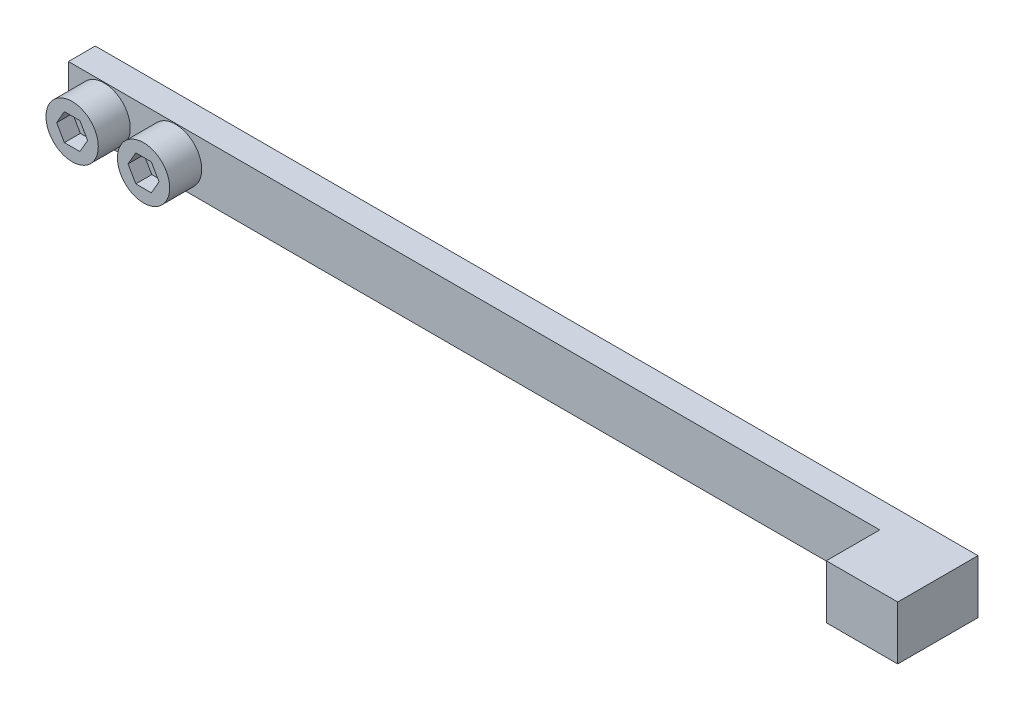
from build123d import *

# Parameters (mm, degrees)
EXTRUDE1_DEPTH     = 4.7752
SKETCH2_R          = 2.3241
EXTRUDE2_DEPTH     = 2.8448
CUT_EXTRUDE1_DEPTH = 1.4224


with BuildPart() as part:
    # Sketch1 → Extrude1 (new body)
    with BuildSketch(Plane(origin=(0, -2.3876, 0), x_dir=(-1, 0, 0), z_dir=(0, 1, 0))):
        Polygon((38.4048, -1.1938), (38.4048, 1.1938), (-33.7312, 1.1938), (-33.7312, 5.9436), (-40.0812, 5.9436), (-40.0812, -1.1938), align=None)
    extrude(amount=EXTRUDE1_DEPTH)

    # Sketch2 → Extrude2 (add)
    with BuildSketch(Plane.XY.offset(1.1938)):
        with Locations(Location((-35.2298, 0, 0), (0, 0, 180))):
            Circle(SKETCH2_R)
        with Locations(Location((-28.8798, 0, 0), (0, 0, 180))):
            Circle(SKETCH2_R)
    extrude(amount=EXTRUDE2_DEPTH)

    # Sketch3 → Cut-Extrude1 (cut)
    with BuildSketch(Plane.XY.offset(4.0386)):
        Polygon((-35.919040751, 1.1938), (-36.608281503, 0), (-35.919040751, -1.1938), (-34.540559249, -1.1938), (-33.851318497, 0), (-34.540559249, 1.1938), align=None)
        Polygon((-30.258281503, 0), (-29.569040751, -1.1938), (-28.190559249, -1.1938), (-27.501318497, 0), (-28.190559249, 1.1938), (-29.569040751, 1.1938), align=None)
    extrude(amount=-CUT_EXTRUDE1_DEPTH, mode=Mode.SUBTRACT)


solid = part.part
